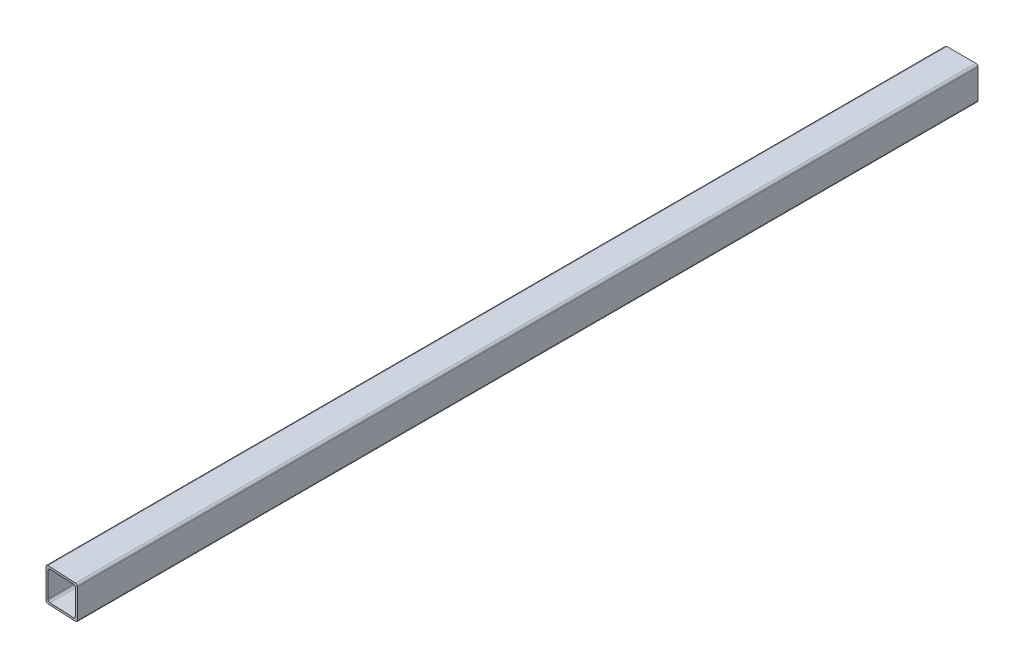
ISO-10303-21;
HEADER;
FILE_DESCRIPTION(('STEP AP214'),'2;1');
FILE_NAME('part.step','',(''),(''),'','','');
FILE_SCHEMA(('AUTOMOTIVE_DESIGN { 1 0 10303 214 1 1 1 1 }'));
ENDSEC;
DATA;
#1=APPLICATION_CONTEXT('core data for automotive mechanical design processes');
#2=APPLICATION_PROTOCOL_DEFINITION('international standard','automotive_design',2000,#1);
#3=PRODUCT_CONTEXT('',#1,'mechanical');
#4=PRODUCT('Part','Part','',(#3));
#5=PRODUCT_RELATED_PRODUCT_CATEGORY('part','',(#4));
#6=PRODUCT_DEFINITION_FORMATION('','',#4);
#7=PRODUCT_DEFINITION_CONTEXT('part definition',#1,'design');
#8=PRODUCT_DEFINITION('design','',#6,#7);
#9=PRODUCT_DEFINITION_SHAPE('','',#8);
#10=(LENGTH_UNIT() NAMED_UNIT(*) SI_UNIT(.MILLI.,.METRE.));
#11=(NAMED_UNIT(*) PLANE_ANGLE_UNIT() SI_UNIT($,.RADIAN.));
#12=(NAMED_UNIT(*) SI_UNIT($,.STERADIAN.) SOLID_ANGLE_UNIT());
#13=UNCERTAINTY_MEASURE_WITH_UNIT(LENGTH_MEASURE(1.E-05),#10,'distance_accuracy_value','');
#14=(GEOMETRIC_REPRESENTATION_CONTEXT(3) GLOBAL_UNCERTAINTY_ASSIGNED_CONTEXT((#13)) GLOBAL_UNIT_ASSIGNED_CONTEXT((#10,
#11,#12)) REPRESENTATION_CONTEXT('',''));
#15=CARTESIAN_POINT('',(0.,0.,0.));
#16=DIRECTION('',(0.,0.,1.));
#17=DIRECTION('',(1.,0.,0.));
#18=AXIS2_PLACEMENT_3D('',#15,#16,#17);
#19=CARTESIAN_POINT('',(34.9999999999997,40.,2281.20744402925));
#20=DIRECTION('',(0.,-1.,0.));
#21=DIRECTION('',(0.,0.,-1.));
#22=AXIS2_PLACEMENT_3D('',#19,#20,#21);
#23=PLANE('',#22);
#24=DIRECTION('',(-0.998752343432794,0.,-0.0499375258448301));
#25=VECTOR('',#24,1.);
#26=CARTESIAN_POINT('',(40.5589801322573,40.,2170.02763805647));
#27=LINE('',#26,#25);
#28=CARTESIAN_POINT('',(34.9999999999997,40.,2169.74968955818));
#29=VERTEX_POINT('',#28);
#30=CARTESIAN_POINT('',(-35.0000000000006,40.,2166.24969595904));
#31=VERTEX_POINT('',#30);
#32=EDGE_CURVE('E306',#29,#31,#27,.T.);
#33=ORIENTED_EDGE('',*,*,#32,.F.);
#34=DIRECTION('',(0.,0.,-1.));
#35=VECTOR('',#34,1.);
#36=CARTESIAN_POINT('',(34.9999999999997,40.,2281.20744402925));
#37=LINE('',#36,#35);
#38=CARTESIAN_POINT('',(34.9999999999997,40.,0.));
#39=VERTEX_POINT('',#38);
#40=EDGE_CURVE('E50',#29,#39,#37,.T.);
#41=ORIENTED_EDGE('',*,*,#40,.T.);
#42=DIRECTION('',(-1.,0.,0.));
#43=VECTOR('',#42,1.);
#44=CARTESIAN_POINT('',(34.9999999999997,40.,0.));
#45=LINE('',#44,#43);
#46=CARTESIAN_POINT('',(-35.0000000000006,40.,0.));
#47=VERTEX_POINT('',#46);
#48=EDGE_CURVE('E201',#39,#47,#45,.T.);
#49=ORIENTED_EDGE('',*,*,#48,.T.);
#50=DIRECTION('',(0.,0.,-1.));
#51=VECTOR('',#50,1.);
#52=CARTESIAN_POINT('',(-35.0000000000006,40.,2281.20744402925));
#53=LINE('',#52,#51);
#54=EDGE_CURVE('E204',#31,#47,#53,.T.);
#55=ORIENTED_EDGE('',*,*,#54,.F.);
#56=EDGE_LOOP('',(#33,#41,#49,#55));
#57=FACE_BOUND('',#56,.T.);
#58=ADVANCED_FACE('F35',(#57),#23,.F.);
#59=CARTESIAN_POINT('',(34.9999999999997,35.0000000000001,2281.20744402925));
#60=DIRECTION('',(0.,0.,-1.));
#61=DIRECTION('',(-1.,0.,0.));
#62=AXIS2_PLACEMENT_3D('',#59,#60,#61);
#63=CYLINDRICAL_SURFACE('',#62,4.99999999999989);
#64=CARTESIAN_POINT('',(34.9999999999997,35.0000000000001,2169.74968955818));
#65=DIRECTION('',(-0.0499375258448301,0.,0.998752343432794));
#66=DIRECTION('',(-0.998752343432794,0.,-0.0499375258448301));
#67=AXIS2_PLACEMENT_3D('',#64,#65,#66);
#68=ELLIPSE('',#67,5.00624607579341,4.99999999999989);
#69=CARTESIAN_POINT('',(39.9999999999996,35.0000000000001,2169.99968910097));
#70=VERTEX_POINT('',#69);
#71=EDGE_CURVE('E242',#70,#29,#68,.T.);
#72=ORIENTED_EDGE('',*,*,#71,.F.);
#73=DIRECTION('',(0.,0.,-1.));
#74=VECTOR('',#73,1.);
#75=CARTESIAN_POINT('',(39.9999999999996,35.0000000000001,2281.20744402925));
#76=LINE('',#75,#74);
#77=CARTESIAN_POINT('',(39.9999999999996,35.0000000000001,0.));
#78=VERTEX_POINT('',#77);
#79=EDGE_CURVE('E207',#70,#78,#76,.T.);
#80=ORIENTED_EDGE('',*,*,#79,.T.);
#81=CARTESIAN_POINT('',(34.9999999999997,35.0000000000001,0.));
#82=DIRECTION('',(0.,0.,1.));
#83=DIRECTION('',(1.,0.,0.));
#84=AXIS2_PLACEMENT_3D('',#81,#82,#83);
#85=CIRCLE('',#84,4.99999999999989);
#86=EDGE_CURVE('E199',#78,#39,#85,.T.);
#87=ORIENTED_EDGE('',*,*,#86,.T.);
#88=ORIENTED_EDGE('',*,*,#40,.F.);
#89=EDGE_LOOP('',(#72,#80,#87,#88));
#90=FACE_BOUND('',#89,.T.);
#91=ADVANCED_FACE('F239',(#90),#63,.T.);
#92=CARTESIAN_POINT('',(39.9999999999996,-35.0000000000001,2281.20744402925));
#93=DIRECTION('',(-1.,0.,0.));
#94=DIRECTION('',(0.,0.,1.));
#95=AXIS2_PLACEMENT_3D('',#92,#93,#94);
#96=PLANE('',#95);
#97=DIRECTION('',(0.,1.,0.));
#98=VECTOR('',#97,1.);
#99=CARTESIAN_POINT('',(39.9999999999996,-35.0000000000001,2169.99968910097));
#100=LINE('',#99,#98);
#101=CARTESIAN_POINT('',(39.9999999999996,-35.0000000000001,2169.99968910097));
#102=VERTEX_POINT('',#101);
#103=EDGE_CURVE('E247',#102,#70,#100,.T.);
#104=ORIENTED_EDGE('',*,*,#103,.F.);
#105=DIRECTION('',(0.,0.,-1.));
#106=VECTOR('',#105,1.);
#107=CARTESIAN_POINT('',(39.9999999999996,-35.0000000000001,2281.20744402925));
#108=LINE('',#107,#106);
#109=CARTESIAN_POINT('',(39.9999999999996,-35.0000000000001,0.));
#110=VERTEX_POINT('',#109);
#111=EDGE_CURVE('E209',#102,#110,#108,.T.);
#112=ORIENTED_EDGE('',*,*,#111,.T.);
#113=DIRECTION('',(0.,1.,0.));
#114=VECTOR('',#113,1.);
#115=CARTESIAN_POINT('',(39.9999999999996,-35.0000000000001,0.));
#116=LINE('',#115,#114);
#117=EDGE_CURVE('E196',#110,#78,#116,.T.);
#118=ORIENTED_EDGE('',*,*,#117,.T.);
#119=ORIENTED_EDGE('',*,*,#79,.F.);
#120=EDGE_LOOP('',(#104,#112,#118,#119));
#121=FACE_BOUND('',#120,.T.);
#122=ADVANCED_FACE('F245',(#121),#96,.F.);
#123=CARTESIAN_POINT('',(34.9999999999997,-35.0000000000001,2281.20744402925));
#124=DIRECTION('',(0.,0.,-1.));
#125=DIRECTION('',(-1.,0.,0.));
#126=AXIS2_PLACEMENT_3D('',#123,#124,#125);
#127=CYLINDRICAL_SURFACE('',#126,4.99999999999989);
#128=CARTESIAN_POINT('',(34.9999999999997,-35.0000000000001,2169.74968955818));
#129=DIRECTION('',(-0.0499375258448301,0.,0.998752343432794));
#130=DIRECTION('',(-0.998752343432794,0.,-0.0499375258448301));
#131=AXIS2_PLACEMENT_3D('',#128,#129,#130);
#132=ELLIPSE('',#131,5.00624607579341,4.99999999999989);
#133=CARTESIAN_POINT('',(34.9999999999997,-40.,2169.74968955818));
#134=VERTEX_POINT('',#133);
#135=EDGE_CURVE('E310',#134,#102,#132,.T.);
#136=ORIENTED_EDGE('',*,*,#135,.F.);
#137=DIRECTION('',(0.,0.,-1.));
#138=VECTOR('',#137,1.);
#139=CARTESIAN_POINT('',(34.9999999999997,-40.,2281.20744402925));
#140=LINE('',#139,#138);
#141=CARTESIAN_POINT('',(34.9999999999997,-40.,0.));
#142=VERTEX_POINT('',#141);
#143=EDGE_CURVE('E211',#134,#142,#140,.T.);
#144=ORIENTED_EDGE('',*,*,#143,.T.);
#145=CARTESIAN_POINT('',(34.9999999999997,-35.0000000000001,0.));
#146=DIRECTION('',(0.,0.,1.));
#147=DIRECTION('',(1.,0.,0.));
#148=AXIS2_PLACEMENT_3D('',#145,#146,#147);
#149=CIRCLE('',#148,4.99999999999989);
#150=EDGE_CURVE('E193',#142,#110,#149,.T.);
#151=ORIENTED_EDGE('',*,*,#150,.T.);
#152=ORIENTED_EDGE('',*,*,#111,.F.);
#153=EDGE_LOOP('',(#136,#144,#151,#152));
#154=FACE_BOUND('',#153,.T.);
#155=ADVANCED_FACE('F250',(#154),#127,.T.);
#156=CARTESIAN_POINT('',(-35.0000000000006,-40.,2281.20744402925));
#157=DIRECTION('',(0.,1.,0.));
#158=DIRECTION('',(0.,0.,1.));
#159=AXIS2_PLACEMENT_3D('',#156,#157,#158);
#160=PLANE('',#159);
#161=DIRECTION('',(0.998752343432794,0.,0.0499375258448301));
#162=VECTOR('',#161,1.);
#163=CARTESIAN_POINT('',(-29.2664569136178,-40.,2166.53637258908));
#164=LINE('',#163,#162);
#165=CARTESIAN_POINT('',(-35.0000000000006,-40.,2166.24969595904));
#166=VERTEX_POINT('',#165);
#167=EDGE_CURVE('E256',#166,#134,#164,.T.);
#168=ORIENTED_EDGE('',*,*,#167,.F.);
#169=DIRECTION('',(0.,0.,-1.));
#170=VECTOR('',#169,1.);
#171=CARTESIAN_POINT('',(-35.0000000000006,-40.,2281.20744402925));
#172=LINE('',#171,#170);
#173=CARTESIAN_POINT('',(-35.0000000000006,-40.,0.));
#174=VERTEX_POINT('',#173);
#175=EDGE_CURVE('E213',#166,#174,#172,.T.);
#176=ORIENTED_EDGE('',*,*,#175,.T.);
#177=DIRECTION('',(1.,0.,0.));
#178=VECTOR('',#177,1.);
#179=CARTESIAN_POINT('',(-35.0000000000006,-40.,0.));
#180=LINE('',#179,#178);
#181=EDGE_CURVE('E190',#174,#142,#180,.T.);
#182=ORIENTED_EDGE('',*,*,#181,.T.);
#183=ORIENTED_EDGE('',*,*,#143,.F.);
#184=EDGE_LOOP('',(#168,#176,#182,#183));
#185=FACE_BOUND('',#184,.T.);
#186=ADVANCED_FACE('F253',(#185),#160,.F.);
#187=CARTESIAN_POINT('',(-35.0000000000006,-35.0000000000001,2281.20744402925));
#188=DIRECTION('',(0.,0.,-1.));
#189=DIRECTION('',(-1.,0.,0.));
#190=AXIS2_PLACEMENT_3D('',#187,#188,#189);
#191=CYLINDRICAL_SURFACE('',#190,4.99999999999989);
#192=CARTESIAN_POINT('',(-35.0000000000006,-35.0000000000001,2166.24969595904));
#193=DIRECTION('',(-0.0499375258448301,0.,0.998752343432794));
#194=DIRECTION('',(-0.998752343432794,0.,-0.0499375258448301));
#195=AXIS2_PLACEMENT_3D('',#192,#193,#194);
#196=ELLIPSE('',#195,5.00624607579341,4.99999999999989);
#197=CARTESIAN_POINT('',(-40.0000000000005,-35.0000000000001,2165.99969641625));
#198=VERTEX_POINT('',#197);
#199=EDGE_CURVE('E260',#198,#166,#196,.T.);
#200=ORIENTED_EDGE('',*,*,#199,.F.);
#201=DIRECTION('',(0.,0.,-1.));
#202=VECTOR('',#201,1.);
#203=CARTESIAN_POINT('',(-40.0000000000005,-35.0000000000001,2281.20744402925));
#204=LINE('',#203,#202);
#205=CARTESIAN_POINT('',(-40.0000000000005,-35.0000000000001,0.));
#206=VERTEX_POINT('',#205);
#207=EDGE_CURVE('E215',#198,#206,#204,.T.);
#208=ORIENTED_EDGE('',*,*,#207,.T.);
#209=CARTESIAN_POINT('',(-35.0000000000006,-35.0000000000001,0.));
#210=DIRECTION('',(0.,0.,1.));
#211=DIRECTION('',(1.,0.,0.));
#212=AXIS2_PLACEMENT_3D('',#209,#210,#211);
#213=CIRCLE('',#212,4.99999999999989);
#214=EDGE_CURVE('E187',#206,#174,#213,.T.);
#215=ORIENTED_EDGE('',*,*,#214,.T.);
#216=ORIENTED_EDGE('',*,*,#175,.F.);
#217=EDGE_LOOP('',(#200,#208,#215,#216));
#218=FACE_BOUND('',#217,.T.);
#219=ADVANCED_FACE('F259',(#218),#191,.T.);
#220=CARTESIAN_POINT('',(-40.0000000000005,35.0000000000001,2281.20744402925));
#221=DIRECTION('',(1.,0.,0.));
#222=DIRECTION('',(0.,0.,-1.));
#223=AXIS2_PLACEMENT_3D('',#220,#221,#222);
#224=PLANE('',#223);
#225=DIRECTION('',(0.,-1.,0.));
#226=VECTOR('',#225,1.);
#227=CARTESIAN_POINT('',(-40.0000000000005,35.0000000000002,2165.99969641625));
#228=LINE('',#227,#226);
#229=CARTESIAN_POINT('',(-40.0000000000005,35.0000000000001,2165.99969641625));
#230=VERTEX_POINT('',#229);
#231=EDGE_CURVE('E223',#230,#198,#228,.T.);
#232=ORIENTED_EDGE('',*,*,#231,.F.);
#233=DIRECTION('',(0.,0.,-1.));
#234=VECTOR('',#233,1.);
#235=CARTESIAN_POINT('',(-40.0000000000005,35.0000000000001,2281.20744402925));
#236=LINE('',#235,#234);
#237=CARTESIAN_POINT('',(-40.0000000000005,35.0000000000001,0.));
#238=VERTEX_POINT('',#237);
#239=EDGE_CURVE('E43',#230,#238,#236,.T.);
#240=ORIENTED_EDGE('',*,*,#239,.T.);
#241=DIRECTION('',(0.,-1.,0.));
#242=VECTOR('',#241,1.);
#243=CARTESIAN_POINT('',(-40.0000000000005,35.0000000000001,0.));
#244=LINE('',#243,#242);
#245=EDGE_CURVE('E184',#238,#206,#244,.T.);
#246=ORIENTED_EDGE('',*,*,#245,.T.);
#247=ORIENTED_EDGE('',*,*,#207,.F.);
#248=EDGE_LOOP('',(#232,#240,#246,#247));
#249=FACE_BOUND('',#248,.T.);
#250=ADVANCED_FACE('F219',(#249),#224,.F.);
#251=CARTESIAN_POINT('',(-35.0000000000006,35.0000000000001,2281.20744402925));
#252=DIRECTION('',(0.,0.,-1.));
#253=DIRECTION('',(-1.,0.,0.));
#254=AXIS2_PLACEMENT_3D('',#251,#252,#253);
#255=CYLINDRICAL_SURFACE('',#254,4.99999999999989);
#256=CARTESIAN_POINT('',(-35.0000000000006,35.0000000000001,2166.24969595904));
#257=DIRECTION('',(-0.0499375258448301,0.,0.998752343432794));
#258=DIRECTION('',(-0.998752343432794,0.,-0.0499375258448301));
#259=AXIS2_PLACEMENT_3D('',#256,#257,#258);
#260=ELLIPSE('',#259,5.00624607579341,4.99999999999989);
#261=EDGE_CURVE('E233',#31,#230,#260,.T.);
#262=ORIENTED_EDGE('',*,*,#261,.F.);
#263=ORIENTED_EDGE('',*,*,#54,.T.);
#264=CARTESIAN_POINT('',(-35.0000000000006,35.0000000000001,0.));
#265=DIRECTION('',(0.,0.,1.));
#266=DIRECTION('',(1.,0.,0.));
#267=AXIS2_PLACEMENT_3D('',#264,#265,#266);
#268=CIRCLE('',#267,4.99999999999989);
#269=EDGE_CURVE('E181',#47,#238,#268,.T.);
#270=ORIENTED_EDGE('',*,*,#269,.T.);
#271=ORIENTED_EDGE('',*,*,#239,.F.);
#272=EDGE_LOOP('',(#262,#263,#270,#271));
#273=FACE_BOUND('',#272,.T.);
#274=ADVANCED_FACE('F37',(#273),#255,.T.);
#275=CARTESIAN_POINT('',(-35.0000000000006,35.0000000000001,0.));
#276=DIRECTION('',(0.,0.,1.));
#277=DIRECTION('',(1.,0.,0.));
#278=AXIS2_PLACEMENT_3D('',#275,#276,#277);
#279=PLANE('',#278);
#280=ORIENTED_EDGE('',*,*,#269,.F.);
#281=ORIENTED_EDGE('',*,*,#48,.F.);
#282=ORIENTED_EDGE('',*,*,#86,.F.);
#283=ORIENTED_EDGE('',*,*,#117,.F.);
#284=ORIENTED_EDGE('',*,*,#150,.F.);
#285=ORIENTED_EDGE('',*,*,#181,.F.);
#286=ORIENTED_EDGE('',*,*,#214,.F.);
#287=ORIENTED_EDGE('',*,*,#245,.F.);
#288=EDGE_LOOP('',(#280,#281,#282,#283,#284,#285,#286,#287));
#289=FACE_BOUND('',#288,.T.);
#290=CARTESIAN_POINT('',(-30.0000000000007,30.0000000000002,0.));
#291=DIRECTION('',(0.,0.,1.));
#292=DIRECTION('',(1.,0.,0.));
#293=AXIS2_PLACEMENT_3D('',#290,#291,#292);
#294=CIRCLE('',#293,4.99999999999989);
#295=CARTESIAN_POINT('',(-30.0000000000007,35.0000000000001,0.));
#296=VERTEX_POINT('',#295);
#297=CARTESIAN_POINT('',(-35.0000000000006,30.0000000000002,0.));
#298=VERTEX_POINT('',#297);
#299=EDGE_CURVE('E262',#296,#298,#294,.T.);
#300=ORIENTED_EDGE('',*,*,#299,.T.);
#301=DIRECTION('',(0.,-1.,0.));
#302=VECTOR('',#301,1.);
#303=CARTESIAN_POINT('',(-35.0000000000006,30.0000000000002,0.));
#304=LINE('',#303,#302);
#305=CARTESIAN_POINT('',(-35.0000000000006,-30.0000000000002,0.));
#306=VERTEX_POINT('',#305);
#307=EDGE_CURVE('E269',#298,#306,#304,.T.);
#308=ORIENTED_EDGE('',*,*,#307,.T.);
#309=CARTESIAN_POINT('',(-30.0000000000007,-30.0000000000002,0.));
#310=DIRECTION('',(0.,0.,1.));
#311=DIRECTION('',(1.,0.,0.));
#312=AXIS2_PLACEMENT_3D('',#309,#310,#311);
#313=CIRCLE('',#312,4.99999999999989);
#314=CARTESIAN_POINT('',(-30.0000000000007,-35.0000000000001,0.));
#315=VERTEX_POINT('',#314);
#316=EDGE_CURVE('E272',#306,#315,#313,.T.);
#317=ORIENTED_EDGE('',*,*,#316,.T.);
#318=DIRECTION('',(1.,0.,0.));
#319=VECTOR('',#318,1.);
#320=CARTESIAN_POINT('',(-30.0000000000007,-35.0000000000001,0.));
#321=LINE('',#320,#319);
#322=CARTESIAN_POINT('',(29.9999999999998,-35.0000000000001,0.));
#323=VERTEX_POINT('',#322);
#324=EDGE_CURVE('E275',#315,#323,#321,.T.);
#325=ORIENTED_EDGE('',*,*,#324,.T.);
#326=CARTESIAN_POINT('',(29.9999999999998,-30.0000000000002,0.));
#327=DIRECTION('',(0.,0.,1.));
#328=DIRECTION('',(1.,0.,0.));
#329=AXIS2_PLACEMENT_3D('',#326,#327,#328);
#330=CIRCLE('',#329,4.99999999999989);
#331=CARTESIAN_POINT('',(34.9999999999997,-30.0000000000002,0.));
#332=VERTEX_POINT('',#331);
#333=EDGE_CURVE('E278',#323,#332,#330,.T.);
#334=ORIENTED_EDGE('',*,*,#333,.T.);
#335=DIRECTION('',(0.,1.,0.));
#336=VECTOR('',#335,1.);
#337=CARTESIAN_POINT('',(34.9999999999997,-30.0000000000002,0.));
#338=LINE('',#337,#336);
#339=CARTESIAN_POINT('',(34.9999999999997,30.0000000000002,0.));
#340=VERTEX_POINT('',#339);
#341=EDGE_CURVE('E281',#332,#340,#338,.T.);
#342=ORIENTED_EDGE('',*,*,#341,.T.);
#343=CARTESIAN_POINT('',(29.9999999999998,30.0000000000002,0.));
#344=DIRECTION('',(0.,0.,1.));
#345=DIRECTION('',(1.,0.,0.));
#346=AXIS2_PLACEMENT_3D('',#343,#344,#345);
#347=CIRCLE('',#346,4.99999999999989);
#348=CARTESIAN_POINT('',(29.9999999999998,35.0000000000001,0.));
#349=VERTEX_POINT('',#348);
#350=EDGE_CURVE('E284',#340,#349,#347,.T.);
#351=ORIENTED_EDGE('',*,*,#350,.T.);
#352=DIRECTION('',(-1.,0.,0.));
#353=VECTOR('',#352,1.);
#354=CARTESIAN_POINT('',(29.9999999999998,35.0000000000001,0.));
#355=LINE('',#354,#353);
#356=EDGE_CURVE('E163',#349,#296,#355,.T.);
#357=ORIENTED_EDGE('',*,*,#356,.T.);
#358=EDGE_LOOP('',(#300,#308,#317,#325,#334,#342,#351,#357));
#359=FACE_BOUND('',#358,.T.);
#360=ADVANCED_FACE('F229',(#289,#359),#279,.F.);
#361=CARTESIAN_POINT('',(29.9999999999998,35.0000000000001,2281.20744402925));
#362=DIRECTION('',(0.,-1.,0.));
#363=DIRECTION('',(0.,0.,-1.));
#364=AXIS2_PLACEMENT_3D('',#361,#362,#363);
#365=PLANE('',#364);
#366=DIRECTION('',(0.,0.,-1.));
#367=VECTOR('',#366,1.);
#368=CARTESIAN_POINT('',(29.9999999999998,35.0000000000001,2281.20744402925));
#369=LINE('',#368,#367);
#370=CARTESIAN_POINT('',(29.9999999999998,35.0000000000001,2169.49969001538));
#371=VERTEX_POINT('',#370);
#372=EDGE_CURVE('E155',#371,#349,#369,.T.);
#373=ORIENTED_EDGE('',*,*,#372,.F.);
#374=DIRECTION('',(-0.998752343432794,0.,-0.0499375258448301));
#375=VECTOR('',#374,1.);
#376=CARTESIAN_POINT('',(35.5714489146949,35.0000000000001,2169.77826195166));
#377=LINE('',#376,#375);
#378=CARTESIAN_POINT('',(-30.0000000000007,35.0000000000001,2166.49969550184));
#379=VERTEX_POINT('',#378);
#380=EDGE_CURVE('E11',#371,#379,#377,.T.);
#381=ORIENTED_EDGE('',*,*,#380,.T.);
#382=DIRECTION('',(0.,0.,-1.));
#383=VECTOR('',#382,1.);
#384=CARTESIAN_POINT('',(-30.0000000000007,35.0000000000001,2281.20744402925));
#385=LINE('',#384,#383);
#386=EDGE_CURVE('E165',#379,#296,#385,.T.);
#387=ORIENTED_EDGE('',*,*,#386,.T.);
#388=ORIENTED_EDGE('',*,*,#356,.F.);
#389=EDGE_LOOP('',(#373,#381,#387,#388));
#390=FACE_BOUND('',#389,.T.);
#391=ADVANCED_FACE('F161',(#390),#365,.T.);
#392=CARTESIAN_POINT('',(29.9999999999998,30.0000000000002,2281.20744402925));
#393=DIRECTION('',(0.,0.,-1.));
#394=DIRECTION('',(-1.,0.,0.));
#395=AXIS2_PLACEMENT_3D('',#392,#393,#394);
#396=CYLINDRICAL_SURFACE('',#395,4.99999999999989);
#397=DIRECTION('',(0.,0.,-1.));
#398=VECTOR('',#397,1.);
#399=CARTESIAN_POINT('',(34.9999999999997,30.0000000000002,2281.20744402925));
#400=LINE('',#399,#398);
#401=CARTESIAN_POINT('',(34.9999999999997,30.0000000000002,2169.74968955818));
#402=VERTEX_POINT('',#401);
#403=EDGE_CURVE('E157',#402,#340,#400,.T.);
#404=ORIENTED_EDGE('',*,*,#403,.F.);
#405=CARTESIAN_POINT('',(29.9999999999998,30.0000000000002,2169.49969001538));
#406=DIRECTION('',(-0.0499375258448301,0.,0.998752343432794));
#407=DIRECTION('',(-0.998752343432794,0.,-0.0499375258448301));
#408=AXIS2_PLACEMENT_3D('',#405,#406,#407);
#409=ELLIPSE('',#408,5.00624607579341,4.99999999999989);
#410=EDGE_CURVE('E148',#402,#371,#409,.T.);
#411=ORIENTED_EDGE('',*,*,#410,.T.);
#412=ORIENTED_EDGE('',*,*,#372,.T.);
#413=ORIENTED_EDGE('',*,*,#350,.F.);
#414=EDGE_LOOP('',(#404,#411,#412,#413));
#415=FACE_BOUND('',#414,.T.);
#416=ADVANCED_FACE('F153',(#415),#396,.F.);
#417=CARTESIAN_POINT('',(34.9999999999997,-30.0000000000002,2281.20744402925));
#418=DIRECTION('',(-1.,0.,0.));
#419=DIRECTION('',(0.,0.,1.));
#420=AXIS2_PLACEMENT_3D('',#417,#418,#419);
#421=PLANE('',#420);
#422=DIRECTION('',(0.,0.,-1.));
#423=VECTOR('',#422,1.);
#424=CARTESIAN_POINT('',(34.9999999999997,-30.0000000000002,2281.20744402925));
#425=LINE('',#424,#423);
#426=CARTESIAN_POINT('',(34.9999999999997,-30.0000000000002,2169.74968955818));
#427=VERTEX_POINT('',#426);
#428=EDGE_CURVE('E167',#427,#332,#425,.T.);
#429=ORIENTED_EDGE('',*,*,#428,.F.);
#430=DIRECTION('',(0.,1.,0.));
#431=VECTOR('',#430,1.);
#432=CARTESIAN_POINT('',(34.9999999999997,-30.0000000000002,2169.74968955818));
#433=LINE('',#432,#431);
#434=EDGE_CURVE('E159',#427,#402,#433,.T.);
#435=ORIENTED_EDGE('',*,*,#434,.T.);
#436=ORIENTED_EDGE('',*,*,#403,.T.);
#437=ORIENTED_EDGE('',*,*,#341,.F.);
#438=EDGE_LOOP('',(#429,#435,#436,#437));
#439=FACE_BOUND('',#438,.T.);
#440=ADVANCED_FACE('F290',(#439),#421,.T.);
#441=CARTESIAN_POINT('',(29.9999999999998,-30.0000000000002,2281.20744402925));
#442=DIRECTION('',(0.,0.,-1.));
#443=DIRECTION('',(-1.,0.,0.));
#444=AXIS2_PLACEMENT_3D('',#441,#442,#443);
#445=CYLINDRICAL_SURFACE('',#444,4.99999999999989);
#446=DIRECTION('',(0.,0.,-1.));
#447=VECTOR('',#446,1.);
#448=CARTESIAN_POINT('',(29.9999999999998,-35.0000000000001,2281.20744402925));
#449=LINE('',#448,#447);
#450=CARTESIAN_POINT('',(29.9999999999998,-35.0000000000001,2169.49969001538));
#451=VERTEX_POINT('',#450);
#452=EDGE_CURVE('E173',#451,#323,#449,.T.);
#453=ORIENTED_EDGE('',*,*,#452,.F.);
#454=CARTESIAN_POINT('',(29.9999999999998,-30.0000000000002,2169.49969001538));
#455=DIRECTION('',(-0.0499375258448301,0.,0.998752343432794));
#456=DIRECTION('',(-0.998752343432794,0.,-0.0499375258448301));
#457=AXIS2_PLACEMENT_3D('',#454,#455,#456);
#458=ELLIPSE('',#457,5.00624607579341,4.99999999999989);
#459=EDGE_CURVE('E292',#451,#427,#458,.T.);
#460=ORIENTED_EDGE('',*,*,#459,.T.);
#461=ORIENTED_EDGE('',*,*,#428,.T.);
#462=ORIENTED_EDGE('',*,*,#333,.F.);
#463=EDGE_LOOP('',(#453,#460,#461,#462));
#464=FACE_BOUND('',#463,.T.);
#465=ADVANCED_FACE('F327',(#464),#445,.F.);
#466=CARTESIAN_POINT('',(-30.0000000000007,-35.0000000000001,2281.20744402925));
#467=DIRECTION('',(0.,1.,0.));
#468=DIRECTION('',(0.,0.,1.));
#469=AXIS2_PLACEMENT_3D('',#466,#467,#468);
#470=PLANE('',#469);
#471=DIRECTION('',(0.,0.,-1.));
#472=VECTOR('',#471,1.);
#473=CARTESIAN_POINT('',(-30.0000000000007,-35.0000000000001,2281.20744402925));
#474=LINE('',#473,#472);
#475=CARTESIAN_POINT('',(-30.0000000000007,-35.0000000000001,2166.49969550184));
#476=VERTEX_POINT('',#475);
#477=EDGE_CURVE('E175',#476,#315,#474,.T.);
#478=ORIENTED_EDGE('',*,*,#477,.F.);
#479=DIRECTION('',(0.998752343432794,0.,0.0499375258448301));
#480=VECTOR('',#479,1.);
#481=CARTESIAN_POINT('',(-24.2789256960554,-35.0000000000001,2166.78574869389));
#482=LINE('',#481,#480);
#483=EDGE_CURVE('E294',#476,#451,#482,.T.);
#484=ORIENTED_EDGE('',*,*,#483,.T.);
#485=ORIENTED_EDGE('',*,*,#452,.T.);
#486=ORIENTED_EDGE('',*,*,#324,.F.);
#487=EDGE_LOOP('',(#478,#484,#485,#486));
#488=FACE_BOUND('',#487,.T.);
#489=ADVANCED_FACE('F324',(#488),#470,.T.);
#490=CARTESIAN_POINT('',(-30.0000000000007,-30.0000000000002,2281.20744402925));
#491=DIRECTION('',(0.,0.,-1.));
#492=DIRECTION('',(-1.,0.,0.));
#493=AXIS2_PLACEMENT_3D('',#490,#491,#492);
#494=CYLINDRICAL_SURFACE('',#493,4.99999999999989);
#495=DIRECTION('',(0.,0.,-1.));
#496=VECTOR('',#495,1.);
#497=CARTESIAN_POINT('',(-35.0000000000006,-30.0000000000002,2281.20744402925));
#498=LINE('',#497,#496);
#499=CARTESIAN_POINT('',(-35.0000000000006,-30.0000000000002,2166.24969595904));
#500=VERTEX_POINT('',#499);
#501=EDGE_CURVE('E177',#500,#306,#498,.T.);
#502=ORIENTED_EDGE('',*,*,#501,.F.);
#503=CARTESIAN_POINT('',(-30.0000000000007,-30.0000000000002,2166.49969550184));
#504=DIRECTION('',(-0.0499375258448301,0.,0.998752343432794));
#505=DIRECTION('',(-0.998752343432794,0.,-0.0499375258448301));
#506=AXIS2_PLACEMENT_3D('',#503,#504,#505);
#507=ELLIPSE('',#506,5.00624607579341,4.99999999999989);
#508=EDGE_CURVE('E299',#500,#476,#507,.T.);
#509=ORIENTED_EDGE('',*,*,#508,.T.);
#510=ORIENTED_EDGE('',*,*,#477,.T.);
#511=ORIENTED_EDGE('',*,*,#316,.F.);
#512=EDGE_LOOP('',(#502,#509,#510,#511));
#513=FACE_BOUND('',#512,.T.);
#514=ADVANCED_FACE('F321',(#513),#494,.F.);
#515=CARTESIAN_POINT('',(-35.0000000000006,30.0000000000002,2281.20744402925));
#516=DIRECTION('',(1.,0.,0.));
#517=DIRECTION('',(0.,0.,-1.));
#518=AXIS2_PLACEMENT_3D('',#515,#516,#517);
#519=PLANE('',#518);
#520=DIRECTION('',(0.,0.,-1.));
#521=VECTOR('',#520,1.);
#522=CARTESIAN_POINT('',(-35.0000000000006,30.0000000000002,2281.20744402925));
#523=LINE('',#522,#521);
#524=CARTESIAN_POINT('',(-35.0000000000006,30.0000000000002,2166.24969595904));
#525=VERTEX_POINT('',#524);
#526=EDGE_CURVE('E179',#525,#298,#523,.T.);
#527=ORIENTED_EDGE('',*,*,#526,.F.);
#528=DIRECTION('',(0.,-1.,0.));
#529=VECTOR('',#528,1.);
#530=CARTESIAN_POINT('',(-35.0000000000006,30.0000000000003,2166.24969595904));
#531=LINE('',#530,#529);
#532=EDGE_CURVE('E302',#525,#500,#531,.T.);
#533=ORIENTED_EDGE('',*,*,#532,.T.);
#534=ORIENTED_EDGE('',*,*,#501,.T.);
#535=ORIENTED_EDGE('',*,*,#307,.F.);
#536=EDGE_LOOP('',(#527,#533,#534,#535));
#537=FACE_BOUND('',#536,.T.);
#538=ADVANCED_FACE('F316',(#537),#519,.T.);
#539=CARTESIAN_POINT('',(-30.0000000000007,30.0000000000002,2281.20744402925));
#540=DIRECTION('',(0.,0.,-1.));
#541=DIRECTION('',(-1.,0.,0.));
#542=AXIS2_PLACEMENT_3D('',#539,#540,#541);
#543=CYLINDRICAL_SURFACE('',#542,4.99999999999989);
#544=ORIENTED_EDGE('',*,*,#386,.F.);
#545=CARTESIAN_POINT('',(-30.0000000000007,30.0000000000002,2166.49969550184));
#546=DIRECTION('',(-0.0499375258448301,0.,0.998752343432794));
#547=DIRECTION('',(-0.998752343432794,0.,-0.0499375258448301));
#548=AXIS2_PLACEMENT_3D('',#545,#546,#547);
#549=ELLIPSE('',#548,5.00624607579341,4.99999999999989);
#550=EDGE_CURVE('E58',#379,#525,#549,.T.);
#551=ORIENTED_EDGE('',*,*,#550,.T.);
#552=ORIENTED_EDGE('',*,*,#526,.T.);
#553=ORIENTED_EDGE('',*,*,#299,.F.);
#554=EDGE_LOOP('',(#544,#551,#552,#553));
#555=FACE_BOUND('',#554,.T.);
#556=ADVANCED_FACE('F312',(#555),#543,.F.);
#557=CARTESIAN_POINT('',(-3543.28104984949,39.9999999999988,1990.83596426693));
#558=DIRECTION('',(-0.0499375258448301,0.,0.998752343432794));
#559=DIRECTION('',(-0.998752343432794,0.,-0.0499375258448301));
#560=AXIS2_PLACEMENT_3D('',#557,#558,#559);
#561=PLANE('',#560);
#562=ORIENTED_EDGE('',*,*,#550,.F.);
#563=ORIENTED_EDGE('',*,*,#380,.F.);
#564=ORIENTED_EDGE('',*,*,#410,.F.);
#565=ORIENTED_EDGE('',*,*,#434,.F.);
#566=ORIENTED_EDGE('',*,*,#459,.F.);
#567=ORIENTED_EDGE('',*,*,#483,.F.);
#568=ORIENTED_EDGE('',*,*,#508,.F.);
#569=ORIENTED_EDGE('',*,*,#532,.F.);
#570=EDGE_LOOP('',(#562,#563,#564,#565,#566,#567,#568,#569));
#571=FACE_BOUND('',#570,.T.);
#572=ORIENTED_EDGE('',*,*,#32,.T.);
#573=ORIENTED_EDGE('',*,*,#261,.T.);
#574=ORIENTED_EDGE('',*,*,#231,.T.);
#575=ORIENTED_EDGE('',*,*,#199,.T.);
#576=ORIENTED_EDGE('',*,*,#167,.T.);
#577=ORIENTED_EDGE('',*,*,#135,.T.);
#578=ORIENTED_EDGE('',*,*,#103,.T.);
#579=ORIENTED_EDGE('',*,*,#71,.T.);
#580=EDGE_LOOP('',(#572,#573,#574,#575,#576,#577,#578,#579));
#581=FACE_BOUND('',#580,.T.);
#582=ADVANCED_FACE('F146',(#571,#581),#561,.T.);
#583=CLOSED_SHELL('',(#58,#91,#122,#155,#186,#219,#250,#274,#360,#391,#416,#440,#465,#489,#514,
#538,#556,#582));
#584=MANIFOLD_SOLID_BREP('B2',#583);
#585=ADVANCED_BREP_SHAPE_REPRESENTATION('',(#18,#584),#14);
#586=SHAPE_DEFINITION_REPRESENTATION(#9,#585);
ENDSEC;
END-ISO-10303-21;
